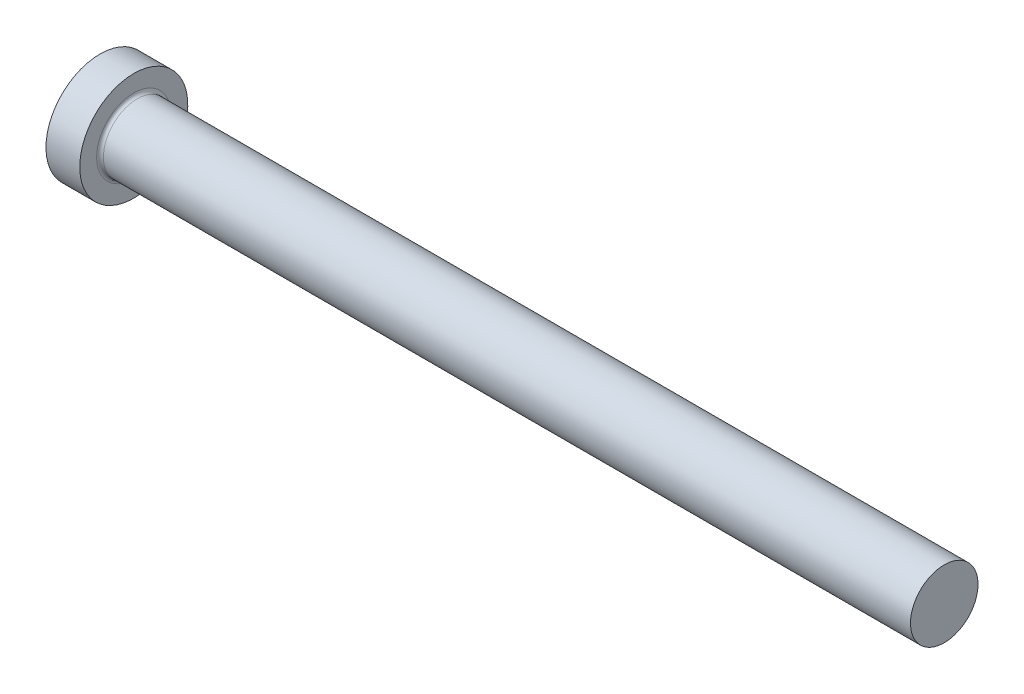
ISO-10303-21;
HEADER;
FILE_DESCRIPTION(('STEP AP214'),'2;1');
FILE_NAME('part.step','',(''),(''),'','','');
FILE_SCHEMA(('AUTOMOTIVE_DESIGN { 1 0 10303 214 1 1 1 1 }'));
ENDSEC;
DATA;
#1=APPLICATION_CONTEXT('core data for automotive mechanical design processes');
#2=APPLICATION_PROTOCOL_DEFINITION('international standard','automotive_design',2000,#1);
#3=PRODUCT_CONTEXT('',#1,'mechanical');
#4=PRODUCT('Part','Part','',(#3));
#5=PRODUCT_RELATED_PRODUCT_CATEGORY('part','',(#4));
#6=PRODUCT_DEFINITION_FORMATION('','',#4);
#7=PRODUCT_DEFINITION_CONTEXT('part definition',#1,'design');
#8=PRODUCT_DEFINITION('design','',#6,#7);
#9=PRODUCT_DEFINITION_SHAPE('','',#8);
#10=(LENGTH_UNIT() NAMED_UNIT(*) SI_UNIT(.MILLI.,.METRE.));
#11=(NAMED_UNIT(*) PLANE_ANGLE_UNIT() SI_UNIT($,.RADIAN.));
#12=(NAMED_UNIT(*) SI_UNIT($,.STERADIAN.) SOLID_ANGLE_UNIT());
#13=UNCERTAINTY_MEASURE_WITH_UNIT(LENGTH_MEASURE(1.E-05),#10,'distance_accuracy_value','');
#14=(GEOMETRIC_REPRESENTATION_CONTEXT(3) GLOBAL_UNCERTAINTY_ASSIGNED_CONTEXT((#13)) GLOBAL_UNIT_ASSIGNED_CONTEXT((#10,
#11,#12)) REPRESENTATION_CONTEXT('',''));
#15=CARTESIAN_POINT('',(0.,0.,0.));
#16=DIRECTION('',(0.,0.,1.));
#17=DIRECTION('',(1.,0.,0.));
#18=AXIS2_PLACEMENT_3D('',#15,#16,#17);
#19=CARTESIAN_POINT('',(0.,0.,0.));
#20=DIRECTION('',(-1.,0.,0.));
#21=DIRECTION('',(0.,-1.,0.));
#22=AXIS2_PLACEMENT_3D('',#19,#20,#21);
#23=PLANE('',#22);
#24=CARTESIAN_POINT('',(0.,0.,0.));
#25=DIRECTION('',(1.,0.,0.));
#26=DIRECTION('',(0.,1.,0.));
#27=AXIS2_PLACEMENT_3D('',#24,#25,#26);
#28=CIRCLE('',#27,8.);
#29=CARTESIAN_POINT('',(0.,8.,0.));
#30=VERTEX_POINT('',#29);
#31=EDGE_CURVE('E25',#30,#30,#28,.T.);
#32=ORIENTED_EDGE('',*,*,#31,.F.);
#33=EDGE_LOOP('',(#32));
#34=FACE_BOUND('',#33,.T.);
#35=ADVANCED_FACE('F14',(#34),#23,.T.);
#36=CARTESIAN_POINT('',(125.,-1.07156594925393E-13,0.));
#37=DIRECTION('',(1.,0.,0.));
#38=DIRECTION('',(0.,1.,0.));
#39=AXIS2_PLACEMENT_3D('',#36,#37,#38);
#40=CYLINDRICAL_SURFACE('',#39,8.);
#41=ORIENTED_EDGE('',*,*,#31,.T.);
#42=EDGE_LOOP('',(#41));
#43=FACE_BOUND('',#42,.T.);
#44=CARTESIAN_POINT('',(5.,0.,0.));
#45=DIRECTION('',(1.,0.,0.));
#46=DIRECTION('',(0.,1.,0.));
#47=AXIS2_PLACEMENT_3D('',#44,#45,#46);
#48=CIRCLE('',#47,8.);
#49=CARTESIAN_POINT('',(5.00000000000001,8.,0.));
#50=VERTEX_POINT('',#49);
#51=EDGE_CURVE('E29',#50,#50,#48,.T.);
#52=ORIENTED_EDGE('',*,*,#51,.F.);
#53=EDGE_LOOP('',(#52));
#54=FACE_BOUND('',#53,.T.);
#55=ADVANCED_FACE('F51',(#43,#54),#40,.T.);
#56=CARTESIAN_POINT('',(5.,8.,0.));
#57=DIRECTION('',(1.,0.,0.));
#58=DIRECTION('',(0.,1.,0.));
#59=AXIS2_PLACEMENT_3D('',#56,#57,#58);
#60=PLANE('',#59);
#61=CARTESIAN_POINT('',(5.,0.,0.));
#62=DIRECTION('',(1.,0.,0.));
#63=DIRECTION('',(0.,1.,0.));
#64=AXIS2_PLACEMENT_3D('',#61,#62,#63);
#65=CIRCLE('',#64,5.5);
#66=CARTESIAN_POINT('',(5.,5.5,0.));
#67=VERTEX_POINT('',#66);
#68=EDGE_CURVE('E9',#67,#67,#65,.F.);
#69=ORIENTED_EDGE('',*,*,#68,.T.);
#70=EDGE_LOOP('',(#69));
#71=FACE_BOUND('',#70,.T.);
#72=ORIENTED_EDGE('',*,*,#51,.T.);
#73=EDGE_LOOP('',(#72));
#74=FACE_BOUND('',#73,.T.);
#75=ADVANCED_FACE('F42',(#71,#74),#60,.T.);
#76=CARTESIAN_POINT('',(125.,-1.07156594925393E-13,0.));
#77=DIRECTION('',(1.,0.,0.));
#78=DIRECTION('',(0.,1.,0.));
#79=AXIS2_PLACEMENT_3D('',#76,#77,#78);
#80=CYLINDRICAL_SURFACE('',#79,5.);
#81=CARTESIAN_POINT('',(5.5,0.,0.));
#82=DIRECTION('',(1.,0.,0.));
#83=DIRECTION('',(0.,1.,0.));
#84=AXIS2_PLACEMENT_3D('',#81,#82,#83);
#85=CIRCLE('',#84,5.);
#86=CARTESIAN_POINT('',(5.5,5.,0.));
#87=VERTEX_POINT('',#86);
#88=EDGE_CURVE('E21',#87,#87,#85,.T.);
#89=ORIENTED_EDGE('',*,*,#88,.T.);
#90=EDGE_LOOP('',(#89));
#91=FACE_BOUND('',#90,.T.);
#92=CARTESIAN_POINT('',(125.,-1.07156594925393E-13,0.));
#93=DIRECTION('',(1.,0.,0.));
#94=DIRECTION('',(0.,1.,0.));
#95=AXIS2_PLACEMENT_3D('',#92,#93,#94);
#96=CIRCLE('',#95,5.);
#97=CARTESIAN_POINT('',(125.,4.99999999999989,0.));
#98=VERTEX_POINT('',#97);
#99=EDGE_CURVE('E34',#98,#98,#96,.T.);
#100=ORIENTED_EDGE('',*,*,#99,.F.);
#101=EDGE_LOOP('',(#100));
#102=FACE_BOUND('',#101,.T.);
#103=ADVANCED_FACE('F40',(#91,#102),#80,.T.);
#104=CARTESIAN_POINT('',(125.,4.99999999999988,0.));
#105=DIRECTION('',(1.,0.,0.));
#106=DIRECTION('',(0.,1.,0.));
#107=AXIS2_PLACEMENT_3D('',#104,#105,#106);
#108=PLANE('',#107);
#109=ORIENTED_EDGE('',*,*,#99,.T.);
#110=EDGE_LOOP('',(#109));
#111=FACE_BOUND('',#110,.T.);
#112=ADVANCED_FACE('F38',(#111),#108,.T.);
#113=CARTESIAN_POINT('',(5.5,0.,0.));
#114=DIRECTION('',(1.,0.,0.));
#115=DIRECTION('',(0.,1.,0.));
#116=AXIS2_PLACEMENT_3D('',#113,#114,#115);
#117=TOROIDAL_SURFACE('',#116,5.5,0.5);
#118=ORIENTED_EDGE('',*,*,#68,.F.);
#119=EDGE_LOOP('',(#118));
#120=FACE_BOUND('',#119,.T.);
#121=ORIENTED_EDGE('',*,*,#88,.F.);
#122=EDGE_LOOP('',(#121));
#123=FACE_BOUND('',#122,.T.);
#124=ADVANCED_FACE('F16',(#120,#123),#117,.F.);
#125=CLOSED_SHELL('',(#35,#55,#75,#103,#112,#124));
#126=MANIFOLD_SOLID_BREP('B1',#125);
#127=ADVANCED_BREP_SHAPE_REPRESENTATION('',(#18,#126),#14);
#128=SHAPE_DEFINITION_REPRESENTATION(#9,#127);
ENDSEC;
END-ISO-10303-21;
